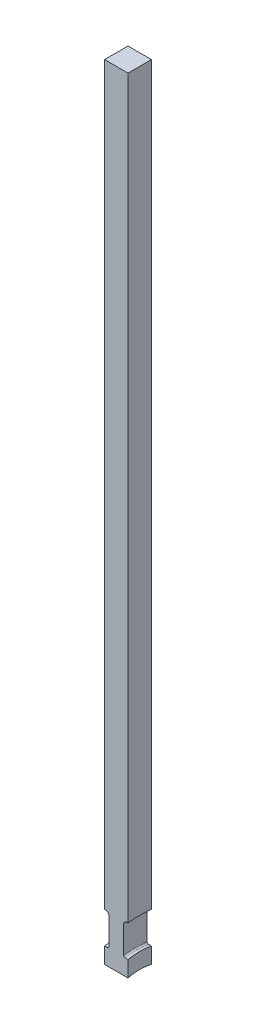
ISO-10303-21;
HEADER;
FILE_DESCRIPTION(('STEP AP214'),'2;1');
FILE_NAME('part.step','',(''),(''),'','','');
FILE_SCHEMA(('AUTOMOTIVE_DESIGN { 1 0 10303 214 1 1 1 1 }'));
ENDSEC;
DATA;
#1=APPLICATION_CONTEXT('core data for automotive mechanical design processes');
#2=APPLICATION_PROTOCOL_DEFINITION('international standard','automotive_design',2000,#1);
#3=PRODUCT_CONTEXT('',#1,'mechanical');
#4=PRODUCT('Part','Part','',(#3));
#5=PRODUCT_RELATED_PRODUCT_CATEGORY('part','',(#4));
#6=PRODUCT_DEFINITION_FORMATION('','',#4);
#7=PRODUCT_DEFINITION_CONTEXT('part definition',#1,'design');
#8=PRODUCT_DEFINITION('design','',#6,#7);
#9=PRODUCT_DEFINITION_SHAPE('','',#8);
#10=(LENGTH_UNIT() NAMED_UNIT(*) SI_UNIT(.MILLI.,.METRE.));
#11=(NAMED_UNIT(*) PLANE_ANGLE_UNIT() SI_UNIT($,.RADIAN.));
#12=(NAMED_UNIT(*) SI_UNIT($,.STERADIAN.) SOLID_ANGLE_UNIT());
#13=UNCERTAINTY_MEASURE_WITH_UNIT(LENGTH_MEASURE(1.E-05),#10,'distance_accuracy_value','');
#14=(GEOMETRIC_REPRESENTATION_CONTEXT(3) GLOBAL_UNCERTAINTY_ASSIGNED_CONTEXT((#13)) GLOBAL_UNIT_ASSIGNED_CONTEXT((#10,
#11,#12)) REPRESENTATION_CONTEXT('',''));
#15=CARTESIAN_POINT('',(0.,0.,0.));
#16=DIRECTION('',(0.,0.,1.));
#17=DIRECTION('',(1.,0.,0.));
#18=AXIS2_PLACEMENT_3D('',#15,#16,#17);
#19=CARTESIAN_POINT('',(3.,212.,3.));
#20=DIRECTION('',(0.,0.,-1.));
#21=DIRECTION('',(0.,1.,0.));
#22=AXIS2_PLACEMENT_3D('',#19,#20,#21);
#23=PLANE('',#22);
#24=DIRECTION('',(-1.,0.,0.));
#25=VECTOR('',#24,1.);
#26=CARTESIAN_POINT('',(-8.84822894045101,15.7162336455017,2.99999999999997));
#27=LINE('',#26,#25);
#28=CARTESIAN_POINT('',(2.286,15.7162336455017,2.99999999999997));
#29=VERTEX_POINT('',#28);
#30=CARTESIAN_POINT('',(3.00000000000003,15.7162336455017,2.99999999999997));
#31=VERTEX_POINT('',#30);
#32=EDGE_CURVE('E310',#29,#31,#27,.F.);
#33=ORIENTED_EDGE('',*,*,#32,.F.);
#34=CARTESIAN_POINT('',(2.286,15.7162336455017,2.99999999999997));
#35=CARTESIAN_POINT('',(2.26483852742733,15.7162138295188,2.99999999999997));
#36=CARTESIAN_POINT('',(2.24368479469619,15.7180272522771,2.99999999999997));
#37=CARTESIAN_POINT('',(2.20200688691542,15.7251715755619,2.99999999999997));
#38=CARTESIAN_POINT('',(2.18148193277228,15.7304979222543,2.99999999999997));
#39=CARTESIAN_POINT('',(2.14161183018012,15.7445219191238,2.99999999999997));
#40=CARTESIAN_POINT('',(2.12226704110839,15.7532205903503,2.99999999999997));
#41=CARTESIAN_POINT('',(2.08529777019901,15.7737154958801,2.99999999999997));
#42=CARTESIAN_POINT('',(2.06767323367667,15.7855116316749,2.99999999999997));
#43=CARTESIAN_POINT('',(2.03448598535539,15.8119557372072,2.99999999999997));
#44=CARTESIAN_POINT('',(2.01894051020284,15.8266253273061,2.99999999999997));
#45=CARTESIAN_POINT('',(1.99048101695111,15.8583304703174,2.99999999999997));
#46=CARTESIAN_POINT('',(1.97756759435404,15.875366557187,2.99999999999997));
#47=CARTESIAN_POINT('',(1.95451065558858,15.9116241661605,2.99999999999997));
#48=CARTESIAN_POINT('',(1.94441753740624,15.9308777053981,2.99999999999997));
#49=CARTESIAN_POINT('',(1.92755440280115,15.9707855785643,2.99999999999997));
#50=CARTESIAN_POINT('',(1.92078322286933,15.9914394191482,2.99999999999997));
#51=CARTESIAN_POINT('',(1.91218275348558,16.0274736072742,2.99999999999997));
#52=CARTESIAN_POINT('',(1.90949097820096,16.0426541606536,2.99999999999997));
#53=CARTESIAN_POINT('',(1.90589964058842,16.0732042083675,2.99999999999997));
#54=CARTESIAN_POINT('',(1.90499757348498,16.088573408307,2.99999999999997));
#55=CARTESIAN_POINT('',(1.905,16.1039486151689,2.99999999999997));
#56=B_SPLINE_CURVE_WITH_KNOTS('',3,(#34,#35,#36,#37,#38,#39,#40,#41,#42,#43,#44,#45,#46,#47,#48,
#49,#50,#51,#52,#53,#54,#55),.UNSPECIFIED.,.F.,.F.,(4,2,2,2,2,2,2,2,2,2,4),(0.,
0.0633953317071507,0.126708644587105,0.190041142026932,0.253371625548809,0.317198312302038,
0.38103942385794,0.445957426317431,0.510852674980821,0.557004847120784,0.603092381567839),.UNSPECIFIED.);
#57=CARTESIAN_POINT('',(1.905,16.1039486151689,2.99999999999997));
#58=VERTEX_POINT('',#57);
#59=EDGE_CURVE('E11',#29,#58,#56,.T.);
#60=ORIENTED_EDGE('',*,*,#59,.T.);
#61=DIRECTION('',(0.,-1.,0.));
#62=VECTOR('',#61,1.);
#63=CARTESIAN_POINT('',(1.905,212.,3.));
#64=LINE('',#63,#62);
#65=CARTESIAN_POINT('',(1.905,23.0435380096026,2.99999999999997));
#66=VERTEX_POINT('',#65);
#67=EDGE_CURVE('E314',#66,#58,#64,.T.);
#68=ORIENTED_EDGE('',*,*,#67,.F.);
#69=CARTESIAN_POINT('',(1.905,23.0435380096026,2.99999999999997));
#70=CARTESIAN_POINT('',(1.90496472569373,23.0870194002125,2.99999999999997));
#71=CARTESIAN_POINT('',(1.90865764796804,23.1304923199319,2.99999999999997));
#72=CARTESIAN_POINT('',(1.92324463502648,23.2161901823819,2.99999999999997));
#73=CARTESIAN_POINT('',(1.93413486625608,23.2584157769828,2.99999999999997));
#74=CARTESIAN_POINT('',(1.96286996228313,23.3404603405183,2.99999999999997));
#75=CARTESIAN_POINT('',(1.9807188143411,23.3802779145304,2.99999999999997));
#76=CARTESIAN_POINT('',(2.02286793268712,23.456326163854,2.99999999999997));
#77=CARTESIAN_POINT('',(2.047166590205,23.492557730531,2.99999999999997));
#78=CARTESIAN_POINT('',(2.10143656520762,23.5602513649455,2.99999999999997));
#79=CARTESIAN_POINT('',(2.13138478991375,23.5917319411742,2.99999999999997));
#80=CARTESIAN_POINT('',(2.19618567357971,23.6491772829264,2.99999999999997));
#81=CARTESIAN_POINT('',(2.23103921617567,23.6751410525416,2.99999999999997));
#82=CARTESIAN_POINT('',(2.30436893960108,23.7205963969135,2.99999999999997));
#83=CARTESIAN_POINT('',(2.34281579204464,23.7401353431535,2.99999999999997));
#84=CARTESIAN_POINT('',(2.42245096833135,23.7724177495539,2.99999999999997));
#85=CARTESIAN_POINT('',(2.46363735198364,23.7851659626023,2.99999999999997));
#86=CARTESIAN_POINT('',(2.53208980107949,23.8001243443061,2.99999999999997));
#87=CARTESIAN_POINT('',(2.55890484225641,23.8044858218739,2.99999999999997));
#88=CARTESIAN_POINT('',(2.61280928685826,23.8103039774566,2.99999999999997));
#89=CARTESIAN_POINT('',(2.63989824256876,23.8117648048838,2.99999999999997));
#90=CARTESIAN_POINT('',(2.667,23.8117617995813,2.99999999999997));
#91=B_SPLINE_CURVE_WITH_KNOTS('',3,(#69,#70,#71,#72,#73,#74,#75,#76,#77,#78,#79,#80,#81,#82,#83,
#84,#85,#86,#87,#88,#89,#90),.UNSPECIFIED.,.F.,.F.,(4,2,2,2,2,2,2,2,2,2,4),(0.,
0.130275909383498,0.260482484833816,0.390763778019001,0.521012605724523,0.650740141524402,
0.780491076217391,0.90926268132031,1.03794403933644,1.11930147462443,1.20054244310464),.UNSPECIFIED.);
#92=CARTESIAN_POINT('',(2.667,23.8117617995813,2.99999999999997));
#93=VERTEX_POINT('',#92);
#94=EDGE_CURVE('E255',#66,#93,#91,.T.);
#95=ORIENTED_EDGE('',*,*,#94,.T.);
#96=DIRECTION('',(-1.,0.,0.));
#97=VECTOR('',#96,1.);
#98=CARTESIAN_POINT('',(-8.84822894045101,23.8117617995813,2.99999999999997));
#99=LINE('',#98,#97);
#100=CARTESIAN_POINT('',(3.00000000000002,23.8117617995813,2.99999999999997));
#101=VERTEX_POINT('',#100);
#102=EDGE_CURVE('E305',#101,#93,#99,.T.);
#103=ORIENTED_EDGE('',*,*,#102,.F.);
#104=DIRECTION('',(0.,-1.,0.));
#105=VECTOR('',#104,1.);
#106=CARTESIAN_POINT('',(3.,212.,3.));
#107=LINE('',#106,#105);
#108=CARTESIAN_POINT('',(3.,212.,3.));
#109=VERTEX_POINT('',#108);
#110=EDGE_CURVE('E327',#109,#101,#107,.T.);
#111=ORIENTED_EDGE('',*,*,#110,.F.);
#112=DIRECTION('',(-1.,0.,0.));
#113=VECTOR('',#112,1.);
#114=CARTESIAN_POINT('',(3.,212.,3.));
#115=LINE('',#114,#113);
#116=CARTESIAN_POINT('',(-3.,212.,3.));
#117=VERTEX_POINT('',#116);
#118=EDGE_CURVE('E197',#109,#117,#115,.T.);
#119=ORIENTED_EDGE('',*,*,#118,.T.);
#120=DIRECTION('',(0.,-1.,0.));
#121=VECTOR('',#120,1.);
#122=CARTESIAN_POINT('',(-3.,212.,3.));
#123=LINE('',#122,#121);
#124=CARTESIAN_POINT('',(-3.00000000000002,23.8117617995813,2.99999999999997));
#125=VERTEX_POINT('',#124);
#126=EDGE_CURVE('E181',#117,#125,#123,.T.);
#127=ORIENTED_EDGE('',*,*,#126,.T.);
#128=DIRECTION('',(-1.,0.,0.));
#129=VECTOR('',#128,1.);
#130=CARTESIAN_POINT('',(-8.84822894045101,23.8117617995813,2.99999999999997));
#131=LINE('',#130,#129);
#132=CARTESIAN_POINT('',(-2.667,23.8117617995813,2.99999999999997));
#133=VERTEX_POINT('',#132);
#134=EDGE_CURVE('E301',#133,#125,#131,.T.);
#135=ORIENTED_EDGE('',*,*,#134,.F.);
#136=CARTESIAN_POINT('',(-2.667,23.8117617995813,2.99999999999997));
#137=CARTESIAN_POINT('',(-2.62437695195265,23.8117995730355,2.99999999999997));
#138=CARTESIAN_POINT('',(-2.58176672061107,23.8081596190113,2.99999999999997));
#139=CARTESIAN_POINT('',(-2.49779708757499,23.7938052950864,2.99999999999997));
#140=CARTESIAN_POINT('',(-2.45643647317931,23.7830980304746,2.99999999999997));
#141=CARTESIAN_POINT('',(-2.37608465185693,23.7548833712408,2.99999999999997));
#142=CARTESIAN_POINT('',(-2.33709441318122,23.7373732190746,2.99999999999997));
#143=CARTESIAN_POINT('',(-2.26259793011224,23.6960818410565,2.99999999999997));
#144=CARTESIAN_POINT('',(-2.22709128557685,23.6723013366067,2.99999999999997));
#145=CARTESIAN_POINT('',(-2.16042730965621,23.6190649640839,2.99999999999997));
#146=CARTESIAN_POINT('',(-2.12928506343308,23.5895902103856,2.99999999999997));
#147=CARTESIAN_POINT('',(-2.07234068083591,23.5258591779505,2.99999999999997));
#148=CARTESIAN_POINT('',(-2.04653965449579,23.4916019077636,2.99999999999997));
#149=CARTESIAN_POINT('',(-2.00080741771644,23.4190082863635,2.99999999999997));
#150=CARTESIAN_POINT('',(-1.98092250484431,23.3806428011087,2.99999999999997));
#151=CARTESIAN_POINT('',(-1.94783046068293,23.3011411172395,2.99999999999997));
#152=CARTESIAN_POINT('',(-1.93462021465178,23.2600062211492,2.99999999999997));
#153=CARTESIAN_POINT('',(-1.91830021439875,23.1894697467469,2.99999999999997));
#154=CARTESIAN_POINT('',(-1.91331546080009,23.1604875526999,2.99999999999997));
#155=CARTESIAN_POINT('',(-1.90666562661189,23.1021866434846,2.99999999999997));
#156=CARTESIAN_POINT('',(-1.90499583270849,23.072868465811,2.99999999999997));
#157=CARTESIAN_POINT('',(-1.905,23.0435380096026,2.99999999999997));
#158=B_SPLINE_CURVE_WITH_KNOTS('',3,(#136,#137,#138,#139,#140,#141,#142,#143,#144,#145,#146,
#147,#148,#149,#150,#151,#152,#153,#154,#155,#156,#157),.UNSPECIFIED.,.F.,.F.,(4,2,2,2,2,2,2,2,
2,2,4),(0.,0.127695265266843,0.25526234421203,0.3828811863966,0.510485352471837,
0.638520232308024,0.766581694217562,0.895620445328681,1.02459892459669,1.1126441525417,
1.20056410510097),.UNSPECIFIED.);
#159=CARTESIAN_POINT('',(-1.905,23.0435380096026,2.99999999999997));
#160=VERTEX_POINT('',#159);
#161=EDGE_CURVE('E224',#133,#160,#158,.T.);
#162=ORIENTED_EDGE('',*,*,#161,.T.);
#163=DIRECTION('',(0.,1.,0.));
#164=VECTOR('',#163,1.);
#165=CARTESIAN_POINT('',(-1.905,212.,3.));
#166=LINE('',#165,#164);
#167=CARTESIAN_POINT('',(-1.905,16.1039486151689,2.99999999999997));
#168=VERTEX_POINT('',#167);
#169=EDGE_CURVE('E312',#168,#160,#166,.T.);
#170=ORIENTED_EDGE('',*,*,#169,.F.);
#171=CARTESIAN_POINT('',(-1.905,16.1039486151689,2.99999999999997));
#172=CARTESIAN_POINT('',(-1.90498313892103,16.0818581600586,2.99999999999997));
#173=CARTESIAN_POINT('',(-1.90685583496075,16.0597712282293,2.99999999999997));
#174=CARTESIAN_POINT('',(-1.91425675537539,16.0162247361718,2.99999999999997));
#175=CARTESIAN_POINT('',(-1.91978390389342,15.9947649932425,2.99999999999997));
#176=CARTESIAN_POINT('',(-1.93437489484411,15.9530662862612,2.99999999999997));
#177=CARTESIAN_POINT('',(-1.94344097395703,15.9328281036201,2.99999999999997));
#178=CARTESIAN_POINT('',(-1.96486395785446,15.8941821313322,2.99999999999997));
#179=CARTESIAN_POINT('',(-1.9772198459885,15.8757737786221,2.99999999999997));
#180=CARTESIAN_POINT('',(-2.00478592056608,15.8414646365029,2.99999999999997));
#181=CARTESIAN_POINT('',(-2.01997366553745,15.8255458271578,2.99999999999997));
#182=CARTESIAN_POINT('',(-2.05285036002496,15.7965326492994,2.99999999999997));
#183=CARTESIAN_POINT('',(-2.07053969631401,15.783438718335,2.99999999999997));
#184=CARTESIAN_POINT('',(-2.10760244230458,15.7606829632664,2.99999999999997));
#185=CARTESIAN_POINT('',(-2.12694358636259,15.7509685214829,2.99999999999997));
#186=CARTESIAN_POINT('',(-2.16699486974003,15.734991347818,2.99999999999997));
#187=CARTESIAN_POINT('',(-2.18770383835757,15.7287257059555,2.99999999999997));
#188=CARTESIAN_POINT('',(-2.22147725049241,15.7216077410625,2.99999999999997));
#189=CARTESIAN_POINT('',(-2.23430798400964,15.7195936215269,2.99999999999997));
#190=CARTESIAN_POINT('',(-2.26009046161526,15.7169069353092,2.99999999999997));
#191=CARTESIAN_POINT('',(-2.27304200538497,15.7162324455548,2.99999999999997));
#192=CARTESIAN_POINT('',(-2.28599999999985,15.716233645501,2.99999999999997));
#193=B_SPLINE_CURVE_WITH_KNOTS('',3,(#171,#172,#173,#174,#175,#176,#177,#178,#179,#180,#181,
#182,#183,#184,#185,#186,#187,#188,#189,#190,#191,#192),.UNSPECIFIED.,.F.,.F.,(4,2,2,2,2,2,2,2,
2,2,4),(0.,0.0661875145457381,0.132355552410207,0.19856547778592,0.264754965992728,
0.330440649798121,0.396136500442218,0.46075815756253,0.525325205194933,0.56422493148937,
0.603068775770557),.UNSPECIFIED.);
#194=CARTESIAN_POINT('',(-2.286,15.7162336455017,2.99999999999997));
#195=VERTEX_POINT('',#194);
#196=EDGE_CURVE('E175',#168,#195,#193,.T.);
#197=ORIENTED_EDGE('',*,*,#196,.T.);
#198=DIRECTION('',(-1.,0.,0.));
#199=VECTOR('',#198,1.);
#200=CARTESIAN_POINT('',(-8.84822894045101,15.7162336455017,2.99999999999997));
#201=LINE('',#200,#199);
#202=CARTESIAN_POINT('',(-3.00000000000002,15.7162336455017,2.99999999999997));
#203=VERTEX_POINT('',#202);
#204=EDGE_CURVE('E159',#203,#195,#201,.F.);
#205=ORIENTED_EDGE('',*,*,#204,.F.);
#206=CARTESIAN_POINT('',(-3.,11.6189500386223,2.99999999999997));
#207=VERTEX_POINT('',#206);
#208=EDGE_CURVE('E171',#203,#207,#123,.T.);
#209=ORIENTED_EDGE('',*,*,#208,.T.);
#210=DIRECTION('',(1.,0.,0.));
#211=VECTOR('',#210,1.);
#212=CARTESIAN_POINT('',(-3.,11.6189500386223,2.99999999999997));
#213=LINE('',#212,#211);
#214=CARTESIAN_POINT('',(3.,11.6189500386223,2.99999999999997));
#215=VERTEX_POINT('',#214);
#216=EDGE_CURVE('E187',#207,#215,#213,.T.);
#217=ORIENTED_EDGE('',*,*,#216,.T.);
#218=EDGE_CURVE('E326',#31,#215,#107,.T.);
#219=ORIENTED_EDGE('',*,*,#218,.F.);
#220=EDGE_LOOP('',(#33,#60,#68,#95,#103,#111,#119,#127,#135,#162,#170,#197,#205,#209,#217,#219));
#221=FACE_BOUND('',#220,.T.);
#222=ADVANCED_FACE('F37',(#221),#23,.F.);
#223=CARTESIAN_POINT('',(3.,212.,-3.00000000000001));
#224=DIRECTION('',(0.,0.,1.));
#225=DIRECTION('',(0.,-1.,0.));
#226=AXIS2_PLACEMENT_3D('',#223,#224,#225);
#227=PLANE('',#226);
#228=DIRECTION('',(-1.,0.,0.));
#229=VECTOR('',#228,1.);
#230=CARTESIAN_POINT('',(-8.84822894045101,15.7162336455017,-3.00000000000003));
#231=LINE('',#230,#229);
#232=CARTESIAN_POINT('',(3.00000000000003,15.7162336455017,-3.00000000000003));
#233=VERTEX_POINT('',#232);
#234=CARTESIAN_POINT('',(2.286,15.7162336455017,-3.00000000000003));
#235=VERTEX_POINT('',#234);
#236=EDGE_CURVE('E308',#233,#235,#231,.T.);
#237=ORIENTED_EDGE('',*,*,#236,.F.);
#238=DIRECTION('',(0.,1.,0.));
#239=VECTOR('',#238,1.);
#240=CARTESIAN_POINT('',(3.,212.,-3.00000000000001));
#241=LINE('',#240,#239);
#242=CARTESIAN_POINT('',(3.,11.6189500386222,-3.00000000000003));
#243=VERTEX_POINT('',#242);
#244=EDGE_CURVE('E198',#243,#233,#241,.T.);
#245=ORIENTED_EDGE('',*,*,#244,.F.);
#246=DIRECTION('',(1.,0.,0.));
#247=VECTOR('',#246,1.);
#248=CARTESIAN_POINT('',(-3.,11.6189500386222,-3.00000000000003));
#249=LINE('',#248,#247);
#250=CARTESIAN_POINT('',(-3.,11.6189500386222,-3.00000000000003));
#251=VERTEX_POINT('',#250);
#252=EDGE_CURVE('E321',#243,#251,#249,.F.);
#253=ORIENTED_EDGE('',*,*,#252,.T.);
#254=DIRECTION('',(0.,1.,0.));
#255=VECTOR('',#254,1.);
#256=CARTESIAN_POINT('',(-3.,212.,-3.00000000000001));
#257=LINE('',#256,#255);
#258=CARTESIAN_POINT('',(-3.,15.7162336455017,-3.00000000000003));
#259=VERTEX_POINT('',#258);
#260=EDGE_CURVE('E191',#251,#259,#257,.T.);
#261=ORIENTED_EDGE('',*,*,#260,.T.);
#262=DIRECTION('',(-1.,0.,0.));
#263=VECTOR('',#262,1.);
#264=CARTESIAN_POINT('',(-8.84822894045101,15.7162336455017,-3.00000000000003));
#265=LINE('',#264,#263);
#266=CARTESIAN_POINT('',(-2.286,15.7162336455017,-3.00000000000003));
#267=VERTEX_POINT('',#266);
#268=EDGE_CURVE('E162',#267,#259,#265,.T.);
#269=ORIENTED_EDGE('',*,*,#268,.F.);
#270=CARTESIAN_POINT('',(-2.286,15.7162336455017,-3.00000000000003));
#271=CARTESIAN_POINT('',(-2.26483852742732,15.7162138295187,-3.00000000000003));
#272=CARTESIAN_POINT('',(-2.24368479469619,15.7180272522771,-3.00000000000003));
#273=CARTESIAN_POINT('',(-2.20200688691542,15.7251715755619,-3.00000000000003));
#274=CARTESIAN_POINT('',(-2.18148193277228,15.7304979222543,-3.00000000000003));
#275=CARTESIAN_POINT('',(-2.14161183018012,15.7445219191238,-3.00000000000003));
#276=CARTESIAN_POINT('',(-2.12226704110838,15.7532205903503,-3.00000000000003));
#277=CARTESIAN_POINT('',(-2.08529777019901,15.7737154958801,-3.00000000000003));
#278=CARTESIAN_POINT('',(-2.06767323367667,15.7855116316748,-3.00000000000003));
#279=CARTESIAN_POINT('',(-2.03448598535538,15.8119557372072,-3.00000000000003));
#280=CARTESIAN_POINT('',(-2.01894051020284,15.8266253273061,-3.00000000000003));
#281=CARTESIAN_POINT('',(-1.99048101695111,15.8583304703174,-3.00000000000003));
#282=CARTESIAN_POINT('',(-1.97756759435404,15.875366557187,-3.00000000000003));
#283=CARTESIAN_POINT('',(-1.95451065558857,15.9116241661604,-3.00000000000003));
#284=CARTESIAN_POINT('',(-1.94441753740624,15.9308777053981,-3.00000000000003));
#285=CARTESIAN_POINT('',(-1.92755440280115,15.9707855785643,-3.00000000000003));
#286=CARTESIAN_POINT('',(-1.92078322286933,15.9914394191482,-3.00000000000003));
#287=CARTESIAN_POINT('',(-1.91218275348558,16.0274736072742,-3.00000000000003));
#288=CARTESIAN_POINT('',(-1.90949097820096,16.0426541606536,-3.00000000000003));
#289=CARTESIAN_POINT('',(-1.90589964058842,16.0732042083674,-3.00000000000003));
#290=CARTESIAN_POINT('',(-1.90499757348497,16.088573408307,-3.00000000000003));
#291=CARTESIAN_POINT('',(-1.905,16.1039486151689,-3.00000000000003));
#292=B_SPLINE_CURVE_WITH_KNOTS('',3,(#270,#271,#272,#273,#274,#275,#276,#277,#278,#279,#280,
#281,#282,#283,#284,#285,#286,#287,#288,#289,#290,#291),.UNSPECIFIED.,.F.,.F.,(4,2,2,2,2,2,2,2,
2,2,4),(0.,0.0633953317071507,0.126708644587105,0.190041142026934,0.25337162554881,
0.317198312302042,0.38103942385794,0.445957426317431,0.510852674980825,0.55700484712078,
0.603092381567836),.UNSPECIFIED.);
#293=CARTESIAN_POINT('',(-1.905,16.1039486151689,-3.00000000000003));
#294=VERTEX_POINT('',#293);
#295=EDGE_CURVE('E274',#267,#294,#292,.T.);
#296=ORIENTED_EDGE('',*,*,#295,.T.);
#297=DIRECTION('',(0.,-1.,0.));
#298=VECTOR('',#297,1.);
#299=CARTESIAN_POINT('',(-1.905,212.,-3.00000000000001));
#300=LINE('',#299,#298);
#301=CARTESIAN_POINT('',(-1.905,23.0435380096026,-3.00000000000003));
#302=VERTEX_POINT('',#301);
#303=EDGE_CURVE('E201',#302,#294,#300,.T.);
#304=ORIENTED_EDGE('',*,*,#303,.F.);
#305=CARTESIAN_POINT('',(-1.905,23.0435380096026,-3.00000000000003));
#306=CARTESIAN_POINT('',(-1.90496472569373,23.0870194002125,-3.00000000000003));
#307=CARTESIAN_POINT('',(-1.90865764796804,23.1304923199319,-3.00000000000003));
#308=CARTESIAN_POINT('',(-1.92324463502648,23.2161901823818,-3.00000000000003));
#309=CARTESIAN_POINT('',(-1.93413486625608,23.2584157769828,-3.00000000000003));
#310=CARTESIAN_POINT('',(-1.96286996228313,23.3404603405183,-3.00000000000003));
#311=CARTESIAN_POINT('',(-1.9807188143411,23.3802779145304,-3.00000000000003));
#312=CARTESIAN_POINT('',(-2.02286793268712,23.456326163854,-3.00000000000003));
#313=CARTESIAN_POINT('',(-2.047166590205,23.492557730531,-3.00000000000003));
#314=CARTESIAN_POINT('',(-2.10143656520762,23.5602513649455,-3.00000000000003));
#315=CARTESIAN_POINT('',(-2.13138478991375,23.5917319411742,-3.00000000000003));
#316=CARTESIAN_POINT('',(-2.19618567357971,23.6491772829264,-3.00000000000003));
#317=CARTESIAN_POINT('',(-2.23103921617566,23.6751410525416,-3.00000000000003));
#318=CARTESIAN_POINT('',(-2.30436893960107,23.7205963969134,-3.00000000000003));
#319=CARTESIAN_POINT('',(-2.34281579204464,23.7401353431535,-3.00000000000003));
#320=CARTESIAN_POINT('',(-2.42245096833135,23.7724177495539,-3.00000000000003));
#321=CARTESIAN_POINT('',(-2.46363735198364,23.7851659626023,-3.00000000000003));
#322=CARTESIAN_POINT('',(-2.53208980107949,23.8001243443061,-3.00000000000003));
#323=CARTESIAN_POINT('',(-2.55890484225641,23.8044858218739,-3.00000000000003));
#324=CARTESIAN_POINT('',(-2.61280928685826,23.8103039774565,-3.00000000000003));
#325=CARTESIAN_POINT('',(-2.63989824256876,23.8117648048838,-3.00000000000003));
#326=CARTESIAN_POINT('',(-2.667,23.8117617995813,-3.00000000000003));
#327=B_SPLINE_CURVE_WITH_KNOTS('',3,(#305,#306,#307,#308,#309,#310,#311,#312,#313,#314,#315,
#316,#317,#318,#319,#320,#321,#322,#323,#324,#325,#326),.UNSPECIFIED.,.F.,.F.,(4,2,2,2,2,2,2,2,
2,2,4),(0.,0.130275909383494,0.260482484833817,0.390763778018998,0.521012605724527,
0.650740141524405,0.780491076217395,0.909262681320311,1.03794403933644,1.11930147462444,
1.20054244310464),.UNSPECIFIED.);
#328=CARTESIAN_POINT('',(-2.667,23.8117617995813,-3.00000000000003));
#329=VERTEX_POINT('',#328);
#330=EDGE_CURVE('E216',#302,#329,#327,.T.);
#331=ORIENTED_EDGE('',*,*,#330,.T.);
#332=DIRECTION('',(-1.,0.,0.));
#333=VECTOR('',#332,1.);
#334=CARTESIAN_POINT('',(-8.84822894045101,23.8117617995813,-3.00000000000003));
#335=LINE('',#334,#333);
#336=CARTESIAN_POINT('',(-3.00000000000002,23.8117617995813,-3.00000000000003));
#337=VERTEX_POINT('',#336);
#338=EDGE_CURVE('E176',#337,#329,#335,.F.);
#339=ORIENTED_EDGE('',*,*,#338,.F.);
#340=CARTESIAN_POINT('',(-3.,212.,-3.00000000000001));
#341=VERTEX_POINT('',#340);
#342=EDGE_CURVE('E185',#337,#341,#257,.T.);
#343=ORIENTED_EDGE('',*,*,#342,.T.);
#344=DIRECTION('',(-1.,0.,0.));
#345=VECTOR('',#344,1.);
#346=CARTESIAN_POINT('',(3.,212.,-3.00000000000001));
#347=LINE('',#346,#345);
#348=CARTESIAN_POINT('',(3.,212.,-3.00000000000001));
#349=VERTEX_POINT('',#348);
#350=EDGE_CURVE('E194',#349,#341,#347,.T.);
#351=ORIENTED_EDGE('',*,*,#350,.F.);
#352=CARTESIAN_POINT('',(3.,23.8117617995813,-3.00000000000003));
#353=VERTEX_POINT('',#352);
#354=EDGE_CURVE('E329',#353,#349,#241,.T.);
#355=ORIENTED_EDGE('',*,*,#354,.F.);
#356=DIRECTION('',(-1.,0.,0.));
#357=VECTOR('',#356,1.);
#358=CARTESIAN_POINT('',(-8.84822894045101,23.8117617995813,-3.00000000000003));
#359=LINE('',#358,#357);
#360=CARTESIAN_POINT('',(2.667,23.8117617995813,-3.00000000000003));
#361=VERTEX_POINT('',#360);
#362=EDGE_CURVE('E303',#361,#353,#359,.F.);
#363=ORIENTED_EDGE('',*,*,#362,.F.);
#364=CARTESIAN_POINT('',(2.667,23.8117617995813,-3.00000000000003));
#365=CARTESIAN_POINT('',(2.62437695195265,23.8117995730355,-3.00000000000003));
#366=CARTESIAN_POINT('',(2.58176672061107,23.8081596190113,-3.00000000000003));
#367=CARTESIAN_POINT('',(2.49779708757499,23.7938052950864,-3.00000000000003));
#368=CARTESIAN_POINT('',(2.45643647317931,23.7830980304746,-3.00000000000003));
#369=CARTESIAN_POINT('',(2.37608465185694,23.7548833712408,-3.00000000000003));
#370=CARTESIAN_POINT('',(2.33709441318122,23.7373732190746,-3.00000000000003));
#371=CARTESIAN_POINT('',(2.26259793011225,23.6960818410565,-3.00000000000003));
#372=CARTESIAN_POINT('',(2.22709128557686,23.6723013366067,-3.00000000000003));
#373=CARTESIAN_POINT('',(2.16042730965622,23.6190649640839,-3.00000000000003));
#374=CARTESIAN_POINT('',(2.12928506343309,23.5895902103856,-3.00000000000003));
#375=CARTESIAN_POINT('',(2.07234068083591,23.5258591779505,-3.00000000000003));
#376=CARTESIAN_POINT('',(2.0465396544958,23.4916019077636,-3.00000000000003));
#377=CARTESIAN_POINT('',(2.00080741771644,23.4190082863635,-3.00000000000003));
#378=CARTESIAN_POINT('',(1.98092250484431,23.3806428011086,-3.00000000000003));
#379=CARTESIAN_POINT('',(1.94783046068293,23.3011411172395,-3.00000000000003));
#380=CARTESIAN_POINT('',(1.93462021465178,23.2600062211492,-3.00000000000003));
#381=CARTESIAN_POINT('',(1.91830021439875,23.1894697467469,-3.00000000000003));
#382=CARTESIAN_POINT('',(1.9133154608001,23.1604875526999,-3.00000000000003));
#383=CARTESIAN_POINT('',(1.90666562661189,23.1021866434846,-3.00000000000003));
#384=CARTESIAN_POINT('',(1.90499583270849,23.072868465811,-3.00000000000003));
#385=CARTESIAN_POINT('',(1.905,23.0435380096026,-3.00000000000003));
#386=B_SPLINE_CURVE_WITH_KNOTS('',3,(#364,#365,#366,#367,#368,#369,#370,#371,#372,#373,#374,
#375,#376,#377,#378,#379,#380,#381,#382,#383,#384,#385),.UNSPECIFIED.,.F.,.F.,(4,2,2,2,2,2,2,2,
2,2,4),(0.,0.127695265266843,0.255262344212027,0.382881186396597,0.510485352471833,
0.638520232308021,0.766581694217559,0.895620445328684,1.02459892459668,1.1126441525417,
1.20056410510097),.UNSPECIFIED.);
#387=CARTESIAN_POINT('',(1.905,23.0435380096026,-3.00000000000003));
#388=VERTEX_POINT('',#387);
#389=EDGE_CURVE('E249',#361,#388,#386,.T.);
#390=ORIENTED_EDGE('',*,*,#389,.T.);
#391=DIRECTION('',(0.,1.,0.));
#392=VECTOR('',#391,1.);
#393=CARTESIAN_POINT('',(1.905,212.,-3.00000000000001));
#394=LINE('',#393,#392);
#395=CARTESIAN_POINT('',(1.905,16.1039486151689,-3.00000000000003));
#396=VERTEX_POINT('',#395);
#397=EDGE_CURVE('E204',#396,#388,#394,.T.);
#398=ORIENTED_EDGE('',*,*,#397,.F.);
#399=CARTESIAN_POINT('',(1.905,16.1039486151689,-3.00000000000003));
#400=CARTESIAN_POINT('',(1.90498313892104,16.0818581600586,-3.00000000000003));
#401=CARTESIAN_POINT('',(1.90685583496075,16.0597712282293,-3.00000000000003));
#402=CARTESIAN_POINT('',(1.91425675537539,16.0162247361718,-3.00000000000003));
#403=CARTESIAN_POINT('',(1.91978390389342,15.9947649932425,-3.00000000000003));
#404=CARTESIAN_POINT('',(1.93437489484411,15.9530662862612,-3.00000000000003));
#405=CARTESIAN_POINT('',(1.94344097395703,15.9328281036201,-3.00000000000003));
#406=CARTESIAN_POINT('',(1.96486395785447,15.8941821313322,-3.00000000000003));
#407=CARTESIAN_POINT('',(1.9772198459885,15.8757737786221,-3.00000000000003));
#408=CARTESIAN_POINT('',(2.00478592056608,15.8414646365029,-3.00000000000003));
#409=CARTESIAN_POINT('',(2.01997366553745,15.8255458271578,-3.00000000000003));
#410=CARTESIAN_POINT('',(2.05285036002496,15.7965326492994,-3.00000000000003));
#411=CARTESIAN_POINT('',(2.07053969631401,15.7834387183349,-3.00000000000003));
#412=CARTESIAN_POINT('',(2.10760244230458,15.7606829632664,-3.00000000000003));
#413=CARTESIAN_POINT('',(2.12694358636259,15.7509685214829,-3.00000000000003));
#414=CARTESIAN_POINT('',(2.16699486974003,15.734991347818,-3.00000000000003));
#415=CARTESIAN_POINT('',(2.18770383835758,15.7287257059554,-3.00000000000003));
#416=CARTESIAN_POINT('',(2.22147725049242,15.7216077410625,-3.00000000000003));
#417=CARTESIAN_POINT('',(2.23430798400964,15.7195936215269,-3.00000000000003));
#418=CARTESIAN_POINT('',(2.26009046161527,15.7169069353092,-3.00000000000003));
#419=CARTESIAN_POINT('',(2.27304200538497,15.7162324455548,-3.00000000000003));
#420=CARTESIAN_POINT('',(2.28599999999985,15.716233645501,-3.00000000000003));
#421=B_SPLINE_CURVE_WITH_KNOTS('',3,(#399,#400,#401,#402,#403,#404,#405,#406,#407,#408,#409,
#410,#411,#412,#413,#414,#415,#416,#417,#418,#419,#420),.UNSPECIFIED.,.F.,.F.,(4,2,2,2,2,2,2,2,
2,2,4),(0.,0.0661875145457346,0.132355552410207,0.198565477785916,0.264754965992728,
0.330440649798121,0.396136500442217,0.460758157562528,0.525325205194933,0.564224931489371,
0.603068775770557),.UNSPECIFIED.);
#422=EDGE_CURVE('E51',#396,#235,#421,.T.);
#423=ORIENTED_EDGE('',*,*,#422,.T.);
#424=EDGE_LOOP('',(#237,#245,#253,#261,#269,#296,#304,#331,#339,#343,#351,#355,#363,#390,#398,#423));
#425=FACE_BOUND('',#424,.T.);
#426=ADVANCED_FACE('F230',(#425),#227,.F.);
#427=CARTESIAN_POINT('',(3.,0.,0.));
#428=DIRECTION('',(-1.,0.,0.));
#429=DIRECTION('',(0.,0.,1.));
#430=AXIS2_PLACEMENT_3D('',#427,#428,#429);
#431=PLANE('',#430);
#432=CARTESIAN_POINT('',(3.00000000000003,0.,0.));
#433=DIRECTION('',(-1.,0.,0.));
#434=DIRECTION('',(0.,0.,1.));
#435=AXIS2_PLACEMENT_3D('',#432,#433,#434);
#436=CIRCLE('',#435,16.);
#437=EDGE_CURVE('E293',#31,#233,#436,.T.);
#438=ORIENTED_EDGE('',*,*,#437,.F.);
#439=ORIENTED_EDGE('',*,*,#218,.T.);
#440=CARTESIAN_POINT('',(3.,0.,0.));
#441=DIRECTION('',(1.,0.,0.));
#442=DIRECTION('',(0.,0.,-1.));
#443=AXIS2_PLACEMENT_3D('',#440,#441,#442);
#444=CIRCLE('',#443,12.);
#445=EDGE_CURVE('E317',#243,#215,#444,.T.);
#446=ORIENTED_EDGE('',*,*,#445,.F.);
#447=ORIENTED_EDGE('',*,*,#244,.T.);
#448=EDGE_LOOP('',(#438,#439,#446,#447));
#449=FACE_BOUND('',#448,.T.);
#450=ADVANCED_FACE('F367',(#449),#431,.F.);
#451=CARTESIAN_POINT('',(-3.,0.,0.));
#452=DIRECTION('',(-1.,0.,0.));
#453=DIRECTION('',(0.,0.,1.));
#454=AXIS2_PLACEMENT_3D('',#451,#452,#453);
#455=PLANE('',#454);
#456=ORIENTED_EDGE('',*,*,#342,.F.);
#457=CARTESIAN_POINT('',(-3.00000000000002,0.,0.));
#458=DIRECTION('',(-1.,0.,0.));
#459=DIRECTION('',(0.,0.,1.));
#460=AXIS2_PLACEMENT_3D('',#457,#458,#459);
#461=CIRCLE('',#460,24.);
#462=EDGE_CURVE('E167',#125,#337,#461,.T.);
#463=ORIENTED_EDGE('',*,*,#462,.F.);
#464=ORIENTED_EDGE('',*,*,#126,.F.);
#465=DIRECTION('',(0.,0.,1.));
#466=VECTOR('',#465,1.);
#467=CARTESIAN_POINT('',(-3.,212.,3.));
#468=LINE('',#467,#466);
#469=EDGE_CURVE('E182',#341,#117,#468,.T.);
#470=ORIENTED_EDGE('',*,*,#469,.F.);
#471=EDGE_LOOP('',(#456,#463,#464,#470));
#472=FACE_BOUND('',#471,.T.);
#473=ADVANCED_FACE('F365',(#472),#455,.T.);
#474=ORIENTED_EDGE('',*,*,#208,.F.);
#475=CARTESIAN_POINT('',(-3.00000000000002,0.,0.));
#476=DIRECTION('',(-1.,0.,0.));
#477=DIRECTION('',(0.,0.,1.));
#478=AXIS2_PLACEMENT_3D('',#475,#476,#477);
#479=CIRCLE('',#478,16.);
#480=EDGE_CURVE('E155',#203,#259,#479,.T.);
#481=ORIENTED_EDGE('',*,*,#480,.T.);
#482=ORIENTED_EDGE('',*,*,#260,.F.);
#483=CARTESIAN_POINT('',(-3.,0.,0.));
#484=DIRECTION('',(1.,0.,0.));
#485=DIRECTION('',(0.,0.,-1.));
#486=AXIS2_PLACEMENT_3D('',#483,#484,#485);
#487=CIRCLE('',#486,12.);
#488=EDGE_CURVE('E180',#251,#207,#487,.T.);
#489=ORIENTED_EDGE('',*,*,#488,.T.);
#490=EDGE_LOOP('',(#474,#481,#482,#489));
#491=FACE_BOUND('',#490,.T.);
#492=ADVANCED_FACE('F179',(#491),#455,.T.);
#493=CARTESIAN_POINT('',(3.,212.,3.));
#494=DIRECTION('',(0.,-1.,0.));
#495=DIRECTION('',(0.,0.,-1.));
#496=AXIS2_PLACEMENT_3D('',#493,#494,#495);
#497=PLANE('',#496);
#498=ORIENTED_EDGE('',*,*,#469,.T.);
#499=ORIENTED_EDGE('',*,*,#118,.F.);
#500=DIRECTION('',(0.,0.,1.));
#501=VECTOR('',#500,1.);
#502=CARTESIAN_POINT('',(3.,212.,3.));
#503=LINE('',#502,#501);
#504=EDGE_CURVE('E193',#349,#109,#503,.T.);
#505=ORIENTED_EDGE('',*,*,#504,.F.);
#506=ORIENTED_EDGE('',*,*,#350,.T.);
#507=EDGE_LOOP('',(#498,#499,#505,#506));
#508=FACE_BOUND('',#507,.T.);
#509=ADVANCED_FACE('F241',(#508),#497,.F.);
#510=CARTESIAN_POINT('',(3.00000000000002,0.,0.));
#511=DIRECTION('',(-1.,0.,0.));
#512=DIRECTION('',(0.,0.,1.));
#513=AXIS2_PLACEMENT_3D('',#510,#511,#512);
#514=CIRCLE('',#513,24.);
#515=EDGE_CURVE('E295',#101,#353,#514,.T.);
#516=ORIENTED_EDGE('',*,*,#515,.T.);
#517=ORIENTED_EDGE('',*,*,#354,.T.);
#518=ORIENTED_EDGE('',*,*,#504,.T.);
#519=ORIENTED_EDGE('',*,*,#110,.T.);
#520=EDGE_LOOP('',(#516,#517,#518,#519));
#521=FACE_BOUND('',#520,.T.);
#522=ADVANCED_FACE('F339',(#521),#431,.F.);
#523=CARTESIAN_POINT('',(-3.,0.,0.));
#524=DIRECTION('',(1.,0.,0.));
#525=DIRECTION('',(0.,0.,-1.));
#526=AXIS2_PLACEMENT_3D('',#523,#524,#525);
#527=CYLINDRICAL_SURFACE('',#526,12.);
#528=ORIENTED_EDGE('',*,*,#488,.F.);
#529=ORIENTED_EDGE('',*,*,#252,.F.);
#530=ORIENTED_EDGE('',*,*,#445,.T.);
#531=ORIENTED_EDGE('',*,*,#216,.F.);
#532=EDGE_LOOP('',(#528,#529,#530,#531));
#533=FACE_BOUND('',#532,.T.);
#534=ADVANCED_FACE('F375',(#533),#527,.F.);
#535=CARTESIAN_POINT('',(-1.905,16.,0.));
#536=DIRECTION('',(-1.,0.,0.));
#537=DIRECTION('',(0.,0.,1.));
#538=AXIS2_PLACEMENT_3D('',#535,#536,#537);
#539=PLANE('',#538);
#540=ORIENTED_EDGE('',*,*,#303,.T.);
#541=CARTESIAN_POINT('',(-1.905,0.,0.));
#542=DIRECTION('',(-1.,0.,0.));
#543=DIRECTION('',(0.,0.,1.));
#544=AXIS2_PLACEMENT_3D('',#541,#542,#543);
#545=CIRCLE('',#544,16.381);
#546=EDGE_CURVE('E287',#294,#168,#545,.F.);
#547=ORIENTED_EDGE('',*,*,#546,.T.);
#548=ORIENTED_EDGE('',*,*,#169,.T.);
#549=CARTESIAN_POINT('',(-1.905,0.,0.));
#550=DIRECTION('',(-1.,0.,0.));
#551=DIRECTION('',(0.,0.,1.));
#552=AXIS2_PLACEMENT_3D('',#549,#550,#551);
#553=CIRCLE('',#552,23.238);
#554=EDGE_CURVE('E206',#160,#302,#553,.T.);
#555=ORIENTED_EDGE('',*,*,#554,.T.);
#556=EDGE_LOOP('',(#540,#547,#548,#555));
#557=FACE_BOUND('',#556,.T.);
#558=ADVANCED_FACE('F359',(#557),#539,.T.);
#559=CARTESIAN_POINT('',(-8.84822894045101,0.,0.));
#560=DIRECTION('',(-1.,0.,0.));
#561=DIRECTION('',(0.,0.,1.));
#562=AXIS2_PLACEMENT_3D('',#559,#560,#561);
#563=CYLINDRICAL_SURFACE('',#562,24.);
#564=ORIENTED_EDGE('',*,*,#338,.T.);
#565=CARTESIAN_POINT('',(-2.667,0.,0.));
#566=DIRECTION('',(-1.,0.,0.));
#567=DIRECTION('',(0.,0.,1.));
#568=AXIS2_PLACEMENT_3D('',#565,#566,#567);
#569=CIRCLE('',#568,24.);
#570=EDGE_CURVE('E209',#329,#133,#569,.F.);
#571=ORIENTED_EDGE('',*,*,#570,.T.);
#572=ORIENTED_EDGE('',*,*,#134,.T.);
#573=ORIENTED_EDGE('',*,*,#462,.T.);
#574=EDGE_LOOP('',(#564,#571,#572,#573));
#575=FACE_BOUND('',#574,.T.);
#576=ADVANCED_FACE('F361',(#575),#563,.F.);
#577=CARTESIAN_POINT('',(-8.84822894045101,0.,0.));
#578=DIRECTION('',(-1.,0.,0.));
#579=DIRECTION('',(0.,0.,1.));
#580=AXIS2_PLACEMENT_3D('',#577,#578,#579);
#581=CYLINDRICAL_SURFACE('',#580,16.);
#582=ORIENTED_EDGE('',*,*,#204,.T.);
#583=CARTESIAN_POINT('',(-2.286,0.,0.));
#584=DIRECTION('',(-1.,0.,0.));
#585=DIRECTION('',(0.,0.,1.));
#586=AXIS2_PLACEMENT_3D('',#583,#584,#585);
#587=CIRCLE('',#586,16.);
#588=EDGE_CURVE('E261',#195,#267,#587,.T.);
#589=ORIENTED_EDGE('',*,*,#588,.T.);
#590=ORIENTED_EDGE('',*,*,#268,.T.);
#591=ORIENTED_EDGE('',*,*,#480,.F.);
#592=EDGE_LOOP('',(#582,#589,#590,#591));
#593=FACE_BOUND('',#592,.T.);
#594=ADVANCED_FACE('F157',(#593),#581,.T.);
#595=CARTESIAN_POINT('',(1.905,16.,0.));
#596=DIRECTION('',(1.,0.,0.));
#597=DIRECTION('',(0.,0.,-1.));
#598=AXIS2_PLACEMENT_3D('',#595,#596,#597);
#599=PLANE('',#598);
#600=ORIENTED_EDGE('',*,*,#67,.T.);
#601=CARTESIAN_POINT('',(1.905,0.,0.));
#602=DIRECTION('',(1.,0.,0.));
#603=DIRECTION('',(0.,0.,-1.));
#604=AXIS2_PLACEMENT_3D('',#601,#602,#603);
#605=CIRCLE('',#604,16.381);
#606=EDGE_CURVE('E285',#58,#396,#605,.F.);
#607=ORIENTED_EDGE('',*,*,#606,.T.);
#608=ORIENTED_EDGE('',*,*,#397,.T.);
#609=CARTESIAN_POINT('',(1.905,0.,0.));
#610=DIRECTION('',(1.,0.,0.));
#611=DIRECTION('',(0.,0.,-1.));
#612=AXIS2_PLACEMENT_3D('',#609,#610,#611);
#613=CIRCLE('',#612,23.238);
#614=EDGE_CURVE('E214',#388,#66,#613,.T.);
#615=ORIENTED_EDGE('',*,*,#614,.T.);
#616=EDGE_LOOP('',(#600,#607,#608,#615));
#617=FACE_BOUND('',#616,.T.);
#618=ADVANCED_FACE('F383',(#617),#599,.T.);
#619=CARTESIAN_POINT('',(-8.84822894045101,0.,0.));
#620=DIRECTION('',(-1.,0.,0.));
#621=DIRECTION('',(0.,0.,1.));
#622=AXIS2_PLACEMENT_3D('',#619,#620,#621);
#623=CYLINDRICAL_SURFACE('',#622,16.);
#624=ORIENTED_EDGE('',*,*,#236,.T.);
#625=CARTESIAN_POINT('',(2.286,0.,0.));
#626=DIRECTION('',(1.,0.,0.));
#627=DIRECTION('',(0.,0.,-1.));
#628=AXIS2_PLACEMENT_3D('',#625,#626,#627);
#629=CIRCLE('',#628,16.);
#630=EDGE_CURVE('E64',#235,#29,#629,.T.);
#631=ORIENTED_EDGE('',*,*,#630,.T.);
#632=ORIENTED_EDGE('',*,*,#32,.T.);
#633=ORIENTED_EDGE('',*,*,#437,.T.);
#634=EDGE_LOOP('',(#624,#631,#632,#633));
#635=FACE_BOUND('',#634,.T.);
#636=ADVANCED_FACE('F386',(#635),#623,.T.);
#637=CARTESIAN_POINT('',(-8.84822894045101,0.,0.));
#638=DIRECTION('',(-1.,0.,0.));
#639=DIRECTION('',(0.,0.,1.));
#640=AXIS2_PLACEMENT_3D('',#637,#638,#639);
#641=CYLINDRICAL_SURFACE('',#640,24.);
#642=ORIENTED_EDGE('',*,*,#102,.T.);
#643=CARTESIAN_POINT('',(2.667,0.,0.));
#644=DIRECTION('',(1.,0.,0.));
#645=DIRECTION('',(0.,0.,-1.));
#646=AXIS2_PLACEMENT_3D('',#643,#644,#645);
#647=CIRCLE('',#646,24.);
#648=EDGE_CURVE('E211',#93,#361,#647,.F.);
#649=ORIENTED_EDGE('',*,*,#648,.T.);
#650=ORIENTED_EDGE('',*,*,#362,.T.);
#651=ORIENTED_EDGE('',*,*,#515,.F.);
#652=EDGE_LOOP('',(#642,#649,#650,#651));
#653=FACE_BOUND('',#652,.T.);
#654=ADVANCED_FACE('F239',(#653),#641,.F.);
#655=CARTESIAN_POINT('',(-2.667,0.,0.));
#656=DIRECTION('',(-1.,0.,0.));
#657=DIRECTION('',(0.,0.,1.));
#658=AXIS2_PLACEMENT_3D('',#655,#656,#657);
#659=TOROIDAL_SURFACE('',#658,23.238,0.762);
#660=ORIENTED_EDGE('',*,*,#161,.F.);
#661=ORIENTED_EDGE('',*,*,#570,.F.);
#662=ORIENTED_EDGE('',*,*,#330,.F.);
#663=ORIENTED_EDGE('',*,*,#554,.F.);
#664=EDGE_LOOP('',(#660,#661,#662,#663));
#665=FACE_BOUND('',#664,.T.);
#666=ADVANCED_FACE('F233',(#665),#659,.F.);
#667=CARTESIAN_POINT('',(2.667,0.,0.));
#668=DIRECTION('',(1.,0.,0.));
#669=DIRECTION('',(0.,0.,-1.));
#670=AXIS2_PLACEMENT_3D('',#667,#668,#669);
#671=TOROIDAL_SURFACE('',#670,23.238,0.762);
#672=ORIENTED_EDGE('',*,*,#94,.F.);
#673=ORIENTED_EDGE('',*,*,#614,.F.);
#674=ORIENTED_EDGE('',*,*,#389,.F.);
#675=ORIENTED_EDGE('',*,*,#648,.F.);
#676=EDGE_LOOP('',(#672,#673,#674,#675));
#677=FACE_BOUND('',#676,.T.);
#678=ADVANCED_FACE('F238',(#677),#671,.F.);
#679=CARTESIAN_POINT('',(-2.286,0.,0.));
#680=DIRECTION('',(-1.,0.,0.));
#681=DIRECTION('',(0.,0.,1.));
#682=AXIS2_PLACEMENT_3D('',#679,#680,#681);
#683=TOROIDAL_SURFACE('',#682,16.381,0.381);
#684=ORIENTED_EDGE('',*,*,#196,.F.);
#685=ORIENTED_EDGE('',*,*,#546,.F.);
#686=ORIENTED_EDGE('',*,*,#295,.F.);
#687=ORIENTED_EDGE('',*,*,#588,.F.);
#688=EDGE_LOOP('',(#684,#685,#686,#687));
#689=FACE_BOUND('',#688,.T.);
#690=ADVANCED_FACE('F245',(#689),#683,.F.);
#691=CARTESIAN_POINT('',(2.286,0.,0.));
#692=DIRECTION('',(1.,0.,0.));
#693=DIRECTION('',(0.,0.,-1.));
#694=AXIS2_PLACEMENT_3D('',#691,#692,#693);
#695=TOROIDAL_SURFACE('',#694,16.381,0.381);
#696=ORIENTED_EDGE('',*,*,#59,.F.);
#697=ORIENTED_EDGE('',*,*,#630,.F.);
#698=ORIENTED_EDGE('',*,*,#422,.F.);
#699=ORIENTED_EDGE('',*,*,#606,.F.);
#700=EDGE_LOOP('',(#696,#697,#698,#699));
#701=FACE_BOUND('',#700,.T.);
#702=ADVANCED_FACE('F39',(#701),#695,.F.);
#703=CLOSED_SHELL('',(#222,#426,#450,#473,#492,#509,#522,#534,#558,#576,#594,#618,#636,#654,
#666,#678,#690,#702));
#704=MANIFOLD_SOLID_BREP('B2',#703);
#705=ADVANCED_BREP_SHAPE_REPRESENTATION('',(#18,#704),#14);
#706=SHAPE_DEFINITION_REPRESENTATION(#9,#705);
ENDSEC;
END-ISO-10303-21;
